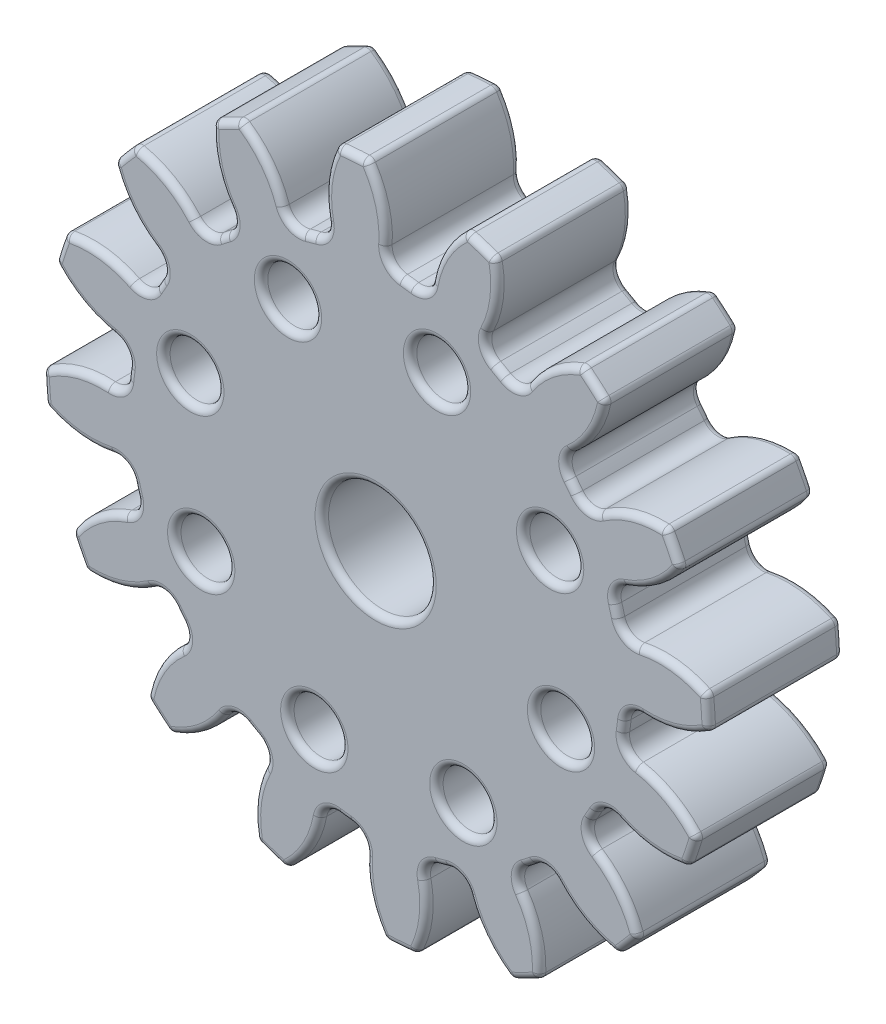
from build123d import *

# Parameters (mm, degrees)
EXTRUDE_1_DEPTH          = 5
PATTERN_CIRCULAR_1_COUNT = 16
SKETCH_2_R               = 18.5625
SKETCH_2_R_2             = 4
EXTRUDE_2_DEPTH          = 5
EXTRUDE_3_DEPTH          = 5
PATTERN_CIRCULAR_2_COUNT = 16
CUT_EXTRUDE_1_DEPTH      = 5
PATTERN_CIRCULAR_3_COUNT = 16
SKETCH_5_R               = 2
CUT_EXTRUDE_2_DEPTH      = 5
FILLET_1_R               = 0.5


with BuildPart() as part:
    # Sketch 1 → Extrude 1 (new, symmetric)
    with BuildSketch(Plane.XY):
        with BuildLine():
            ThreePointArc((-0.671963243, 24.740876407), (-1.805963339, 24.6840231), (-2.936162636, 24.575220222))
            ThreePointArc((-2.936162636, 24.575220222), (-3.765035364, 21.459091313), (-3.231357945, 18.279079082))
            ThreePointArc((-3.231357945, 18.279079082), (-1.354472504, 18.513017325), (0.536475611, 18.554746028))
            ThreePointArc((0.536475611, 18.554746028), (0.601627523, 21.778570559), (-0.671963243, 24.740876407))
        make_face()
    extrude(amount=EXTRUDE_1_DEPTH, both=True)


with BuildPart() as pattern_circular_1_1:
    # Pattern Circular 1: pattern copy
    add(part.part.rotate(Axis((0, 0, 0), (0, 0, 1)), 1 * 360 / PATTERN_CIRCULAR_1_COUNT))


with BuildPart() as pattern_circular_1_2:
    # Pattern Circular 1: pattern copy
    add(part.part.rotate(Axis((0, 0, 0), (0, 0, 1)), 2 * 360 / PATTERN_CIRCULAR_1_COUNT))


with BuildPart() as pattern_circular_1_3:
    # Pattern Circular 1: pattern copy
    add(part.part.rotate(Axis((0, 0, 0), (0, 0, 1)), 3 * 360 / PATTERN_CIRCULAR_1_COUNT))


with BuildPart() as pattern_circular_1_4:
    # Pattern Circular 1: pattern copy
    add(part.part.rotate(Axis((0, 0, 0), (0, 0, 1)), 4 * 360 / PATTERN_CIRCULAR_1_COUNT))


with BuildPart() as pattern_circular_1_5:
    # Pattern Circular 1: pattern copy
    add(part.part.rotate(Axis((0, 0, 0), (0, 0, 1)), 5 * 360 / PATTERN_CIRCULAR_1_COUNT))


with BuildPart() as pattern_circular_1_6:
    # Pattern Circular 1: pattern copy
    add(part.part.rotate(Axis((0, 0, 0), (0, 0, 1)), 6 * 360 / PATTERN_CIRCULAR_1_COUNT))


with BuildPart() as pattern_circular_1_7:
    # Pattern Circular 1: pattern copy
    add(part.part.rotate(Axis((0, 0, 0), (0, 0, 1)), 7 * 360 / PATTERN_CIRCULAR_1_COUNT))


with BuildPart() as pattern_circular_1_8:
    # Pattern Circular 1: pattern copy
    add(part.part.rotate(Axis((0, 0, 0), (0, 0, 1)), 8 * 360 / PATTERN_CIRCULAR_1_COUNT))


with BuildPart() as pattern_circular_1_9:
    # Pattern Circular 1: pattern copy
    add(part.part.rotate(Axis((0, 0, 0), (0, 0, 1)), 9 * 360 / PATTERN_CIRCULAR_1_COUNT))


with BuildPart() as pattern_circular_1_10:
    # Pattern Circular 1: pattern copy
    add(part.part.rotate(Axis((0, 0, 0), (0, 0, 1)), 10 * 360 / PATTERN_CIRCULAR_1_COUNT))


with BuildPart() as pattern_circular_1_11:
    # Pattern Circular 1: pattern copy
    add(part.part.rotate(Axis((0, 0, 0), (0, 0, 1)), 11 * 360 / PATTERN_CIRCULAR_1_COUNT))


with BuildPart() as pattern_circular_1_12:
    # Pattern Circular 1: pattern copy
    add(part.part.rotate(Axis((0, 0, 0), (0, 0, 1)), 12 * 360 / PATTERN_CIRCULAR_1_COUNT))


with BuildPart() as pattern_circular_1_13:
    # Pattern Circular 1: pattern copy
    add(part.part.rotate(Axis((0, 0, 0), (0, 0, 1)), 13 * 360 / PATTERN_CIRCULAR_1_COUNT))


with BuildPart() as pattern_circular_1_14:
    # Pattern Circular 1: pattern copy
    add(part.part.rotate(Axis((0, 0, 0), (0, 0, 1)), 14 * 360 / PATTERN_CIRCULAR_1_COUNT))


with BuildPart() as pattern_circular_1_15:
    # Pattern Circular 1: pattern copy
    add(part.part.rotate(Axis((0, 0, 0), (0, 0, 1)), 15 * 360 / PATTERN_CIRCULAR_1_COUNT))


with BuildPart() as part_1:
    add(part.part)

    add(pattern_circular_1_1.part)  # Extrude 2 merges Pattern Circular 1_1

    add(pattern_circular_1_2.part)  # Extrude 2 merges Pattern Circular 1_2

    add(pattern_circular_1_3.part)  # Extrude 2 merges Pattern Circular 1_3

    add(pattern_circular_1_4.part)  # Extrude 2 merges Pattern Circular 1_4

    add(pattern_circular_1_5.part)  # Extrude 2 merges Pattern Circular 1_5

    add(pattern_circular_1_6.part)  # Extrude 2 merges Pattern Circular 1_6

    add(pattern_circular_1_7.part)  # Extrude 2 merges Pattern Circular 1_7

    add(pattern_circular_1_8.part)  # Extrude 2 merges Pattern Circular 1_8

    add(pattern_circular_1_9.part)  # Extrude 2 merges Pattern Circular 1_9

    add(pattern_circular_1_10.part)  # Extrude 2 merges Pattern Circular 1_10

    add(pattern_circular_1_11.part)  # Extrude 2 merges Pattern Circular 1_11

    add(pattern_circular_1_12.part)  # Extrude 2 merges Pattern Circular 1_12

    add(pattern_circular_1_13.part)  # Extrude 2 merges Pattern Circular 1_13

    add(pattern_circular_1_14.part)  # Extrude 2 merges Pattern Circular 1_14

    add(pattern_circular_1_15.part)  # Extrude 2 merges Pattern Circular 1_15
    # Sketch 2 → Extrude 2 (add, symmetric)
    with BuildSketch(Plane.XY):
        Circle(SKETCH_2_R)
        Circle(SKETCH_2_R_2, mode=Mode.SUBTRACT)
    extrude(amount=EXTRUDE_2_DEPTH, both=True)

    # Sketch 3 → Extrude 3 (add, symmetric)
    with BuildSketch(Plane.XY):
        with BuildLine():
            ThreePointArc((0.536475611, 18.554746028), (0.657903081, 19.181192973), (0.726508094, 19.815601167))
            ThreePointArc((0.726508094, 19.815601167), (1.024144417, 18.911813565), (1.8660827, 18.468463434))
            ThreePointArc((1.8660827, 18.468463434), (1.202053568, 18.523538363), (0.536475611, 18.554746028))
        make_face()
        with BuildLine():
            ThreePointArc((4.009715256, 18.124254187), (3.356658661, 18.256485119), (2.699277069, 18.365192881))
            ThreePointArc((2.699277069, 18.365192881), (3.623977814, 18.589576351), (4.133258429, 19.393350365))
            ThreePointArc((4.133258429, 19.393350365), (4.044902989, 18.761390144), (4.009715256, 18.124254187))
        make_face()
    extrude_3 = extrude(amount=EXTRUDE_3_DEPTH, both=True)

    # Pattern Circular 2: Extrude 3 ×16 about axis
    pattern_circular_2_axis = Axis((0, 0, 0), (0, 0, 1))
    for i in range(1, PATTERN_CIRCULAR_2_COUNT):
        add(extrude_3.rotate(pattern_circular_2_axis, i * 360 / PATTERN_CIRCULAR_2_COUNT))

    # Sketch 4 → Cut-Extrude 1 (cut, symmetric)
    with BuildSketch(Plane.XY):
        with BuildLine():
            ThreePointArc((-0.671963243, 24.740876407), (-0.810309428, 24.736731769), (-0.948630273, 24.731813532))
            ThreePointArc((-0.948630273, 24.731813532), (-0.700689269, 24.676771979), (-0.511776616, 24.507018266))
            ThreePointArc((-0.511776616, 24.507018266), (-0.590782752, 24.624692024), (-0.671963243, 24.740876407))
        make_face()
        with BuildLine():
            ThreePointArc((-2.936162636, 24.575220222), (-2.999568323, 24.448457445), (-3.060606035, 24.320537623))
            ThreePointArc((-3.060606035, 24.320537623), (-2.898412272, 24.515979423), (-2.661122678, 24.606522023))
            ThreePointArc((-2.661122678, 24.606522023), (-2.798686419, 24.591255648), (-2.936162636, 24.575220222))
        make_face()
    cut_extrude_1 = extrude(amount=CUT_EXTRUDE_1_DEPTH, both=True, mode=Mode.SUBTRACT)

    # Pattern Circular 3: Cut-Extrude 1 ×16 about axis
    pattern_circular_3_axis = Axis((0, 0, 0), (0, 0, 1))
    for i in range(1, PATTERN_CIRCULAR_3_COUNT):
        add(cut_extrude_1.rotate(pattern_circular_3_axis, i * 360 / PATTERN_CIRCULAR_3_COUNT), mode=Mode.SUBTRACT)

    # Sketch 5 → Cut-Extrude 2 (cut, symmetric)
    with BuildSketch(Plane.XY):
        with Locations((4.556617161, 13.765436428)):
            Circle(SKETCH_5_R)
        with Locations((12.955648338, 6.511618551)):
            Circle(SKETCH_5_R)
        with Locations((13.765436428, -4.556617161)):
            Circle(SKETCH_5_R)
        with Locations((6.511618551, -12.955648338)):
            Circle(SKETCH_5_R)
        with Locations((-4.556617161, -13.765436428)):
            Circle(SKETCH_5_R)
        with Locations((-12.955648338, -6.511618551)):
            Circle(SKETCH_5_R)
        with Locations((-13.765436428, 4.556617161)):
            Circle(SKETCH_5_R)
        with Locations((-6.511618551, 12.955648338)):
            Circle(SKETCH_5_R)
    extrude(amount=CUT_EXTRUDE_2_DEPTH, both=True, mode=Mode.SUBTRACT)

    # Fillet 1
    fillet_1_edges = [part_1.edges().sort_by_distance(p)[0] for p in [
        (2.556617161, 13.765436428, -5),
        (2.556617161, 13.765436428, 5),
        (10.955648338, 6.511618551, -5),
        (10.955648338, 6.511618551, 5),
        (11.765436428, -4.556617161, -5),
        (11.765436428, -4.556617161, 5),
        (4.511618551, -12.955648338, -5),
        (4.511618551, -12.955648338, 5),
        (-6.556617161, -13.765436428, -5),
        (-6.556617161, -13.765436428, 5),
        (-14.955648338, -6.511618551, -5),
        (-14.955648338, -6.511618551, 5),
        (-15.765436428, 4.556617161, -5),
        (-15.765436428, 4.556617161, 5),
        (-8.511618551, 12.955648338, -5),
        (-8.511618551, 12.955648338, 5),
        (0.490625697, 22.26246997, -5),
        (0.490625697, 22.26246997, 5),
        (1.024144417, 18.911813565, -5),
        (1.024144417, 18.911813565, 5),
        (2.283263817, 18.421539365, -5),
        (2.283263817, 18.421539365, 5),
        (3.623977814, 18.589576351, -5),
        (3.623977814, 18.589576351, 5),
        (8.97275746, 20.380086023, -5),
        (8.97275746, 20.380086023, 5),
        (8.183423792, 17.080314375, -5),
        (8.183423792, 17.080314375, 5),
        (9.159078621, 16.145515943, -5),
        (9.159078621, 16.145515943, 5),
        (10.462041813, 15.78769284, -5),
        (10.462041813, 15.78769284, 5),
        (16.088868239, 15.395018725, -5),
        (16.088868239, 15.395018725, 5),
        (14.096851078, 12.648492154, -5),
        (14.096851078, 12.648492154, 5),
        (14.640506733, 11.411484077, -5),
        (14.640506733, 11.411484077, 5),
        (15.707354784, 10.58227621, -5),
        (15.707354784, 10.58227621, 5),
        (20.755594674, 8.066199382, -5),
        (20.755594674, 8.066199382, 5),
        (-4, 0, -5),
        (17.864160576, 6.291051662, -5),
        (17.864160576, 6.291051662, 5),
        (-4, 0, 5),
        (17.893050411, 4.940157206, -5),
        (17.893050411, 4.940157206, 5),
        (18.561365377, 3.765803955, -5),
        (18.561365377, 3.765803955, 5),
        (22.26246997, -0.490625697, -5),
        (22.26246997, -0.490625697, 5),
        (18.911813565, -1.024144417, -5),
        (18.911813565, -1.024144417, 5),
        (18.421539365, -2.283263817, -5),
        (18.421539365, -2.283263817, 5),
        (18.589576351, -3.623977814, -5),
        (18.589576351, -3.623977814, 5),
        (20.380086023, -8.97275746, -5),
        (20.380086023, -8.97275746, 5),
        (17.080314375, -8.183423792, -5),
        (17.080314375, -8.183423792, 5),
        (16.145515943, -9.159078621, -5),
        (16.145515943, -9.159078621, 5),
        (15.78769284, -10.462041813, -5),
        (15.78769284, -10.462041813, 5),
        (15.395018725, -16.088868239, -5),
        (15.395018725, -16.088868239, 5),
        (12.648492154, -14.096851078, -5),
        (12.648492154, -14.096851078, 5),
        (11.411484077, -14.640506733, -5),
        (11.411484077, -14.640506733, 5),
        (10.58227621, -15.707354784, -5),
        (10.58227621, -15.707354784, 5),
        (8.066199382, -20.755594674, -5),
        (8.066199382, -20.755594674, 5),
        (6.291051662, -17.864160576, -5),
        (6.291051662, -17.864160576, 5),
        (4.940157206, -17.893050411, -5),
        (4.940157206, -17.893050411, 5),
        (3.765803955, -18.561365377, -5),
        (3.765803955, -18.561365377, 5),
        (-0.490625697, -22.26246997, -5),
        (-0.490625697, -22.26246997, 5),
        (-1.024144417, -18.911813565, -5),
        (-1.024144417, -18.911813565, 5),
        (-2.283263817, -18.421539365, -5),
        (-2.283263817, -18.421539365, 5),
        (-3.623977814, -18.589576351, -5),
        (-3.623977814, -18.589576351, 5),
        (-8.97275746, -20.380086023, -5),
        (-8.97275746, -20.380086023, 5),
        (-8.183423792, -17.080314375, -5),
        (-8.183423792, -17.080314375, 5),
        (-9.159078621, -16.145515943, -5),
        (-9.159078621, -16.145515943, 5),
        (-10.462041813, -15.78769284, -5),
        (-10.462041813, -15.78769284, 5),
        (-16.088868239, -15.395018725, -5),
        (-16.088868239, -15.395018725, 5),
        (-14.096851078, -12.648492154, -5),
        (-14.096851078, -12.648492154, 5),
        (-14.640506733, -11.411484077, -5),
        (-14.640506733, -11.411484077, 5),
        (-15.707354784, -10.58227621, -5),
        (-15.707354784, -10.58227621, 5),
        (-20.755594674, -8.066199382, -5),
        (-20.755594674, -8.066199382, 5),
        (-17.864160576, -6.291051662, -5),
        (-17.864160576, -6.291051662, 5),
        (-17.893050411, -4.940157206, -5),
        (-17.893050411, -4.940157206, 5),
        (-18.561365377, -3.765803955, -5),
        (-18.561365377, -3.765803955, 5),
        (-22.26246997, 0.490625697, -5),
        (-22.26246997, 0.490625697, 5),
        (-18.911813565, 1.024144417, -5),
        (-18.911813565, 1.024144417, 5),
        (-18.421539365, 2.283263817, -5),
        (-18.421539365, 2.283263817, 5),
        (-18.589576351, 3.623977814, -5),
        (-18.589576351, 3.623977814, 5),
        (-20.380086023, 8.97275746, -5),
        (-20.380086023, 8.97275746, 5),
        (-17.080314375, 8.183423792, -5),
        (-17.080314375, 8.183423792, 5),
        (-16.145515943, 9.159078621, -5),
        (-16.145515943, 9.159078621, 5),
        (-15.78769284, 10.462041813, -5),
        (-15.78769284, 10.462041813, 5),
        (-15.395018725, 16.088868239, -5),
        (-15.395018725, 16.088868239, 5),
        (-12.648492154, 14.096851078, -5),
        (-12.648492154, 14.096851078, 5),
        (-11.411484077, 14.640506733, -5),
        (-11.411484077, 14.640506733, 5),
        (-10.58227621, 15.707354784, -5),
        (-10.58227621, 15.707354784, 5),
        (-8.066199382, 20.755594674, -5),
        (-8.066199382, 20.755594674, 5),
        (-6.291051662, 17.864160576, -5),
        (-6.291051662, 17.864160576, 5),
        (-4.940157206, 17.893050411, -5),
        (-4.940157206, 17.893050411, 5),
        (-3.765803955, 18.561365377, -5),
        (-3.765803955, 18.561365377, 5),
        (-1.805963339, 24.6840231, -5),
        (-1.805963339, 24.6840231, 5),
        (-0.700689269, 24.676771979, -5),
        (-0.700689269, 24.676771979, 5),
        (-3.725645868, 21.953993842, -5),
        (-3.725645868, 21.953993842, 5),
        (-2.898412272, 24.515979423, -5),
        (-2.898412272, 24.515979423, 5),
        (7.777674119, 23.496175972, -5),
        (7.777674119, 23.496175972, 5),
        (8.796039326, 23.066506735, -5),
        (8.796039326, 23.066506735, 5),
        (4.959381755, 21.708588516, -5),
        (4.959381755, 21.708588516, 5),
        (6.704075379, 23.758985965, -5),
        (6.704075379, 23.758985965, 5),
        (16.177231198, 18.731249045, -5),
        (16.177231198, 18.731249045, 5),
        (16.953650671, 17.944574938, -5),
        (16.953650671, 17.944574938, 5),
        (12.889388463, 18.158247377, -5),
        (12.889388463, 18.158247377, 5),
        (15.285928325, 19.38490227, -5),
        (15.285928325, 19.38490227, 5),
        (22.113951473, 11.11465925, -5),
        (22.113951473, 11.11465925, 5),
        (22.530222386, 10.090744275, -5),
        (22.530222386, 10.090744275, 5),
        (18.857102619, 11.84347768, -5),
        (18.857102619, 11.84347768, 5),
        (21.540637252, 12.059642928, -5),
        (21.540637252, 12.059642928, 5),
        (24.6840231, 1.805963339, -5),
        (24.6840231, 1.805963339, 5),
        (24.676771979, 0.700689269, -5),
        (24.676771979, 0.700689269, 5),
        (21.953993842, 3.725645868, -5),
        (21.953993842, 3.725645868, 5),
        (24.515979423, 2.898412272, -5),
        (24.515979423, 2.898412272, 5),
        (23.496175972, -7.777674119, -5),
        (23.496175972, -7.777674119, 5),
        (23.066506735, -8.796039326, -5),
        (23.066506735, -8.796039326, 5),
        (21.708588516, -4.959381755, -5),
        (21.708588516, -4.959381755, 5),
        (23.758985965, -6.704075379, -5),
        (23.758985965, -6.704075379, 5),
        (18.731249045, -16.177231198, -5),
        (18.731249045, -16.177231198, 5),
        (17.944574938, -16.953650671, -5),
        (17.944574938, -16.953650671, 5),
        (18.158247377, -12.889388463, -5),
        (18.158247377, -12.889388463, 5),
        (19.38490227, -15.285928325, -5),
        (19.38490227, -15.285928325, 5),
        (11.11465925, -22.113951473, -5),
        (11.11465925, -22.113951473, 5),
        (10.090744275, -22.530222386, -5),
        (10.090744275, -22.530222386, 5),
        (11.84347768, -18.857102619, -5),
        (11.84347768, -18.857102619, 5),
        (12.059642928, -21.540637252, -5),
        (12.059642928, -21.540637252, 5),
        (1.805963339, -24.6840231, -5),
        (1.805963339, -24.6840231, 5),
        (0.700689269, -24.676771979, -5),
        (0.700689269, -24.676771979, 5),
        (3.725645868, -21.953993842, -5),
        (3.725645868, -21.953993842, 5),
        (2.898412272, -24.515979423, -5),
        (2.898412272, -24.515979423, 5),
        (-7.777674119, -23.496175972, -5),
        (-7.777674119, -23.496175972, 5),
        (-8.796039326, -23.066506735, -5),
        (-8.796039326, -23.066506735, 5),
        (-4.959381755, -21.708588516, -5),
        (-4.959381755, -21.708588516, 5),
        (-6.704075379, -23.758985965, -5),
        (-6.704075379, -23.758985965, 5),
        (-16.177231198, -18.731249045, -5),
        (-16.177231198, -18.731249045, 5),
        (-16.953650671, -17.944574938, -5),
        (-16.953650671, -17.944574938, 5),
        (-12.889388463, -18.158247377, -5),
        (-12.889388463, -18.158247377, 5),
        (-15.285928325, -19.38490227, -5),
        (-15.285928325, -19.38490227, 5),
        (-22.113951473, -11.11465925, -5),
        (-22.113951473, -11.11465925, 5),
        (-22.530222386, -10.090744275, -5),
        (-22.530222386, -10.090744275, 5),
        (-18.857102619, -11.84347768, -5),
        (-18.857102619, -11.84347768, 5),
        (-21.540637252, -12.059642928, -5),
        (-21.540637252, -12.059642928, 5),
        (-24.6840231, -1.805963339, -5),
        (-24.6840231, -1.805963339, 5),
        (-24.676771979, -0.700689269, -5),
        (-24.676771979, -0.700689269, 5),
        (-21.953993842, -3.725645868, -5),
        (-21.953993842, -3.725645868, 5),
        (-24.515979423, -2.898412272, -5),
        (-24.515979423, -2.898412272, 5),
        (-23.496175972, 7.777674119, -5),
        (-23.496175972, 7.777674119, 5),
        (-23.066506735, 8.796039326, -5),
        (-23.066506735, 8.796039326, 5),
        (-21.708588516, 4.959381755, -5),
        (-21.708588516, 4.959381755, 5),
        (-23.758985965, 6.704075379, -5),
        (-23.758985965, 6.704075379, 5),
        (-18.731249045, 16.177231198, -5),
        (-18.731249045, 16.177231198, 5),
        (-17.944574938, 16.953650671, -5),
        (-17.944574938, 16.953650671, 5),
        (-18.158247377, 12.889388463, -5),
        (-18.158247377, 12.889388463, 5),
        (-19.38490227, 15.285928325, -5),
        (-19.38490227, 15.285928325, 5),
        (-11.11465925, 22.113951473, -5),
        (-11.11465925, 22.113951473, 5),
        (-10.090744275, 22.530222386, -5),
        (-10.090744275, 22.530222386, 5),
        (-11.84347768, 18.857102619, -5),
        (-11.84347768, 18.857102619, 5),
        (-12.059642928, 21.540637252, -5),
        (-12.059642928, 21.540637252, 5),
    ]]
    fillet(fillet_1_edges, radius=FILLET_1_R)


solid = part_1.part
